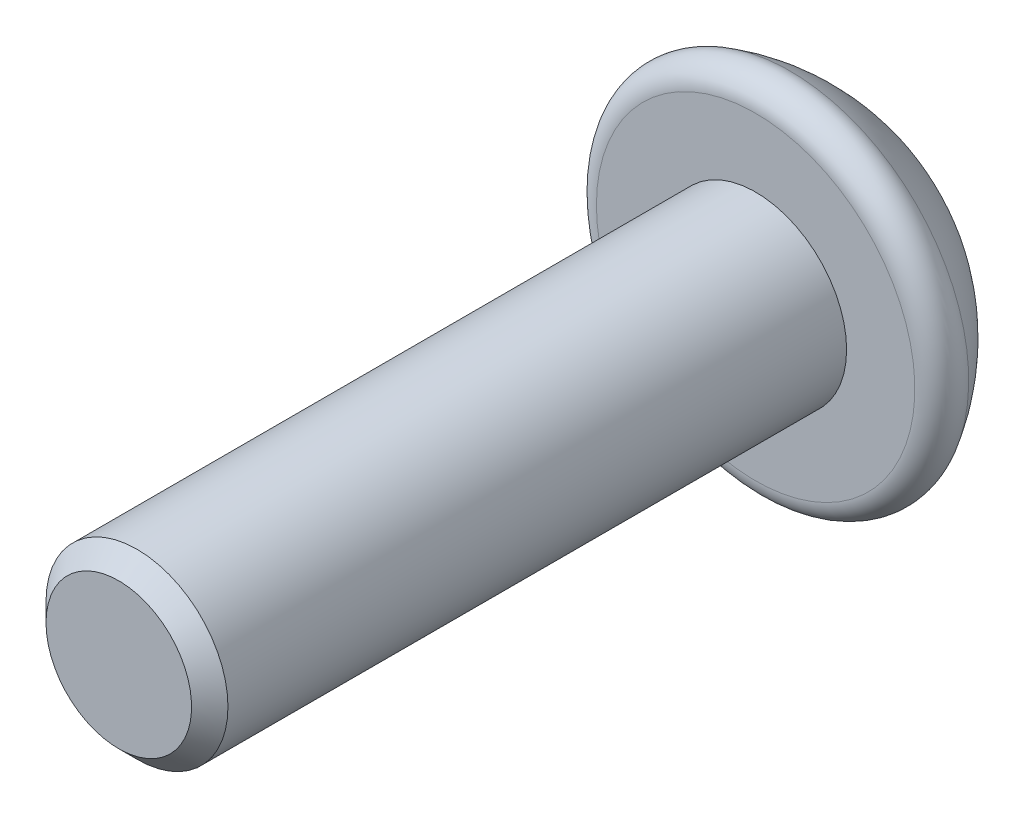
ISO-10303-21;
HEADER;
FILE_DESCRIPTION(('STEP AP214'),'2;1');
FILE_NAME('part.step','',(''),(''),'','','');
FILE_SCHEMA(('AUTOMOTIVE_DESIGN { 1 0 10303 214 1 1 1 1 }'));
ENDSEC;
DATA;
#1=APPLICATION_CONTEXT('core data for automotive mechanical design processes');
#2=APPLICATION_PROTOCOL_DEFINITION('international standard','automotive_design',2000,#1);
#3=PRODUCT_CONTEXT('',#1,'mechanical');
#4=PRODUCT('Part','Part','',(#3));
#5=PRODUCT_RELATED_PRODUCT_CATEGORY('part','',(#4));
#6=PRODUCT_DEFINITION_FORMATION('','',#4);
#7=PRODUCT_DEFINITION_CONTEXT('part definition',#1,'design');
#8=PRODUCT_DEFINITION('design','',#6,#7);
#9=PRODUCT_DEFINITION_SHAPE('','',#8);
#10=(LENGTH_UNIT() NAMED_UNIT(*) SI_UNIT(.MILLI.,.METRE.));
#11=(NAMED_UNIT(*) PLANE_ANGLE_UNIT() SI_UNIT($,.RADIAN.));
#12=(NAMED_UNIT(*) SI_UNIT($,.STERADIAN.) SOLID_ANGLE_UNIT());
#13=UNCERTAINTY_MEASURE_WITH_UNIT(LENGTH_MEASURE(1.E-05),#10,'distance_accuracy_value','');
#14=(GEOMETRIC_REPRESENTATION_CONTEXT(3) GLOBAL_UNCERTAINTY_ASSIGNED_CONTEXT((#13)) GLOBAL_UNIT_ASSIGNED_CONTEXT((#10,
#11,#12)) REPRESENTATION_CONTEXT('',''));
#15=CARTESIAN_POINT('',(0.,0.,0.));
#16=DIRECTION('',(0.,0.,1.));
#17=DIRECTION('',(1.,0.,0.));
#18=AXIS2_PLACEMENT_3D('',#15,#16,#17);
#19=CARTESIAN_POINT('',(0.,0.,1.5625));
#20=DIRECTION('',(0.,0.,-1.));
#21=DIRECTION('',(1.,0.,0.));
#22=AXIS2_PLACEMENT_3D('',#19,#20,#21);
#23=SPHERICAL_SURFACE('',#22,4.5625);
#24=CARTESIAN_POINT('',(0.,0.,-0.753846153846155));
#25=DIRECTION('',(0.,0.,-1.));
#26=DIRECTION('',(-1.,0.,0.));
#27=AXIS2_PLACEMENT_3D('',#24,#25,#26);
#28=CIRCLE('',#27,3.93076923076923);
#29=CARTESIAN_POINT('',(-3.93076923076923,0.,-0.753846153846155));
#30=VERTEX_POINT('',#29);
#31=EDGE_CURVE('E427',#30,#30,#28,.T.);
#32=ORIENTED_EDGE('',*,*,#31,.T.);
#33=EDGE_LOOP('',(#32));
#34=FACE_BOUND('',#33,.T.);
#35=CARTESIAN_POINT('',(-0.6,0.,1.5625));
#36=DIRECTION('',(1.,0.,0.));
#37=DIRECTION('',(0.,1.,0.));
#38=AXIS2_PLACEMENT_3D('',#35,#36,#37);
#39=CIRCLE('',#38,4.52287588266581);
#40=CARTESIAN_POINT('',(-0.6,0.6,-2.92040154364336));
#41=VERTEX_POINT('',#40);
#42=CARTESIAN_POINT('',(-0.6,2.78657495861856,-2.));
#43=VERTEX_POINT('',#42);
#44=EDGE_CURVE('E481',#41,#43,#39,.T.);
#45=ORIENTED_EDGE('',*,*,#44,.F.);
#46=CARTESIAN_POINT('',(0.,0.6,1.5625));
#47=DIRECTION('',(0.,-1.,0.));
#48=DIRECTION('',(1.,0.,0.));
#49=AXIS2_PLACEMENT_3D('',#46,#47,#48);
#50=CIRCLE('',#49,4.52287588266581);
#51=CARTESIAN_POINT('',(-2.78657495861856,0.6,-2.));
#52=VERTEX_POINT('',#51);
#53=EDGE_CURVE('E479',#52,#41,#50,.T.);
#54=ORIENTED_EDGE('',*,*,#53,.F.);
#55=CARTESIAN_POINT('',(0.,0.,-2.));
#56=DIRECTION('',(0.,0.,1.));
#57=DIRECTION('',(1.,0.,0.));
#58=AXIS2_PLACEMENT_3D('',#55,#56,#57);
#59=CIRCLE('',#58,2.85043856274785);
#60=CARTESIAN_POINT('',(-2.78657495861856,-0.6,-2.));
#61=VERTEX_POINT('',#60);
#62=EDGE_CURVE('E478',#52,#61,#59,.T.);
#63=ORIENTED_EDGE('',*,*,#62,.T.);
#64=CARTESIAN_POINT('',(0.,-0.6,1.5625));
#65=DIRECTION('',(0.,1.,0.));
#66=DIRECTION('',(0.,0.,1.));
#67=AXIS2_PLACEMENT_3D('',#64,#65,#66);
#68=CIRCLE('',#67,4.52287588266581);
#69=CARTESIAN_POINT('',(-0.6,-0.6,-2.92040154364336));
#70=VERTEX_POINT('',#69);
#71=EDGE_CURVE('E420',#70,#61,#68,.T.);
#72=ORIENTED_EDGE('',*,*,#71,.F.);
#73=CARTESIAN_POINT('',(-0.6,0.,1.5625));
#74=DIRECTION('',(1.,0.,0.));
#75=DIRECTION('',(0.,1.,0.));
#76=AXIS2_PLACEMENT_3D('',#73,#74,#75);
#77=CIRCLE('',#76,4.52287588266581);
#78=CARTESIAN_POINT('',(-0.6,-2.78657495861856,-2.));
#79=VERTEX_POINT('',#78);
#80=EDGE_CURVE('E373',#79,#70,#77,.T.);
#81=ORIENTED_EDGE('',*,*,#80,.F.);
#82=CARTESIAN_POINT('',(0.6,-2.78657495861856,-2.));
#83=VERTEX_POINT('',#82);
#84=EDGE_CURVE('E433',#79,#83,#59,.T.);
#85=ORIENTED_EDGE('',*,*,#84,.T.);
#86=CARTESIAN_POINT('',(0.6,0.,1.5625));
#87=DIRECTION('',(-1.,0.,0.));
#88=DIRECTION('',(0.,-1.,0.));
#89=AXIS2_PLACEMENT_3D('',#86,#87,#88);
#90=CIRCLE('',#89,4.52287588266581);
#91=CARTESIAN_POINT('',(0.6,-0.6,-2.92040154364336));
#92=VERTEX_POINT('',#91);
#93=EDGE_CURVE('E472',#92,#83,#90,.T.);
#94=ORIENTED_EDGE('',*,*,#93,.F.);
#95=CARTESIAN_POINT('',(0.,-0.6,1.5625));
#96=DIRECTION('',(0.,1.,0.));
#97=DIRECTION('',(0.,0.,1.));
#98=AXIS2_PLACEMENT_3D('',#95,#96,#97);
#99=CIRCLE('',#98,4.52287588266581);
#100=CARTESIAN_POINT('',(2.78657495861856,-0.6,-2.));
#101=VERTEX_POINT('',#100);
#102=EDGE_CURVE('E470',#101,#92,#99,.T.);
#103=ORIENTED_EDGE('',*,*,#102,.F.);
#104=CARTESIAN_POINT('',(2.78657495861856,0.6,-2.));
#105=VERTEX_POINT('',#104);
#106=EDGE_CURVE('E464',#101,#105,#59,.T.);
#107=ORIENTED_EDGE('',*,*,#106,.T.);
#108=CARTESIAN_POINT('',(0.,0.6,1.5625));
#109=DIRECTION('',(0.,-1.,0.));
#110=DIRECTION('',(0.,0.,-1.));
#111=AXIS2_PLACEMENT_3D('',#108,#109,#110);
#112=CIRCLE('',#111,4.52287588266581);
#113=CARTESIAN_POINT('',(0.6,0.6,-2.92040154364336));
#114=VERTEX_POINT('',#113);
#115=EDGE_CURVE('E467',#114,#105,#112,.T.);
#116=ORIENTED_EDGE('',*,*,#115,.F.);
#117=CARTESIAN_POINT('',(0.6,0.,1.5625));
#118=DIRECTION('',(-1.,0.,0.));
#119=DIRECTION('',(0.,-1.,0.));
#120=AXIS2_PLACEMENT_3D('',#117,#118,#119);
#121=CIRCLE('',#120,4.52287588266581);
#122=CARTESIAN_POINT('',(0.6,2.78657495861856,-2.));
#123=VERTEX_POINT('',#122);
#124=EDGE_CURVE('E474',#123,#114,#121,.T.);
#125=ORIENTED_EDGE('',*,*,#124,.F.);
#126=EDGE_CURVE('E468',#123,#43,#59,.T.);
#127=ORIENTED_EDGE('',*,*,#126,.T.);
#128=EDGE_LOOP('',(#45,#54,#63,#72,#81,#85,#94,#103,#107,#116,#125,#127));
#129=FACE_BOUND('',#128,.T.);
#130=ADVANCED_FACE('F350',(#34,#129),#23,.T.);
#131=CARTESIAN_POINT('',(0.,0.,0.));
#132=DIRECTION('',(0.,0.,-1.));
#133=DIRECTION('',(-1.,0.,0.));
#134=AXIS2_PLACEMENT_3D('',#131,#132,#133);
#135=PLANE('',#134);
#136=CARTESIAN_POINT('',(0.,0.,0.));
#137=DIRECTION('',(0.,0.,1.));
#138=DIRECTION('',(1.,0.,0.));
#139=AXIS2_PLACEMENT_3D('',#136,#137,#138);
#140=CIRCLE('',#139,2.);
#141=CARTESIAN_POINT('',(2.,0.,0.));
#142=VERTEX_POINT('',#141);
#143=EDGE_CURVE('E424',#142,#142,#140,.T.);
#144=ORIENTED_EDGE('',*,*,#143,.F.);
#145=EDGE_LOOP('',(#144));
#146=FACE_BOUND('',#145,.T.);
#147=CARTESIAN_POINT('',(0.,0.,0.));
#148=DIRECTION('',(0.,0.,-1.));
#149=DIRECTION('',(-1.,0.,0.));
#150=AXIS2_PLACEMENT_3D('',#147,#148,#149);
#151=CIRCLE('',#150,3.5);
#152=CARTESIAN_POINT('',(-3.5,0.,0.));
#153=VERTEX_POINT('',#152);
#154=EDGE_CURVE('E461',#153,#153,#151,.T.);
#155=ORIENTED_EDGE('',*,*,#154,.F.);
#156=EDGE_LOOP('',(#155));
#157=FACE_BOUND('',#156,.T.);
#158=ADVANCED_FACE('F352',(#146,#157),#135,.F.);
#159=CARTESIAN_POINT('',(0.,0.,-0.5));
#160=DIRECTION('',(0.,0.,-1.));
#161=DIRECTION('',(-1.,0.,0.));
#162=AXIS2_PLACEMENT_3D('',#159,#160,#161);
#163=TOROIDAL_SURFACE('',#162,3.5,0.500000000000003);
#164=ORIENTED_EDGE('',*,*,#31,.F.);
#165=EDGE_LOOP('',(#164));
#166=FACE_BOUND('',#165,.T.);
#167=ORIENTED_EDGE('',*,*,#154,.T.);
#168=EDGE_LOOP('',(#167));
#169=FACE_BOUND('',#168,.T.);
#170=ADVANCED_FACE('F506',(#166,#169),#163,.T.);
#171=CARTESIAN_POINT('',(-3.5,-0.6,-2.));
#172=DIRECTION('',(0.,1.,0.));
#173=DIRECTION('',(0.,0.,1.));
#174=AXIS2_PLACEMENT_3D('',#171,#172,#173);
#175=PLANE('',#174);
#176=ORIENTED_EDGE('',*,*,#71,.T.);
#177=DIRECTION('',(1.,0.,0.));
#178=VECTOR('',#177,1.);
#179=CARTESIAN_POINT('',(-3.5,-0.6,-2.));
#180=LINE('',#179,#178);
#181=CARTESIAN_POINT('',(-0.6,-0.6,-2.));
#182=VERTEX_POINT('',#181);
#183=EDGE_CURVE('E416',#61,#182,#180,.T.);
#184=ORIENTED_EDGE('',*,*,#183,.T.);
#185=DIRECTION('',(0.,0.,-1.));
#186=VECTOR('',#185,1.);
#187=CARTESIAN_POINT('',(-0.6,-0.6,-2.));
#188=LINE('',#187,#186);
#189=EDGE_CURVE('E418',#182,#70,#188,.T.);
#190=ORIENTED_EDGE('',*,*,#189,.T.);
#191=EDGE_LOOP('',(#176,#184,#190));
#192=FACE_BOUND('',#191,.T.);
#193=ADVANCED_FACE('F417',(#192),#175,.T.);
#194=CARTESIAN_POINT('',(-0.6,-0.6,-2.));
#195=DIRECTION('',(1.,0.,0.));
#196=DIRECTION('',(0.,1.,0.));
#197=AXIS2_PLACEMENT_3D('',#194,#195,#196);
#198=PLANE('',#197);
#199=ORIENTED_EDGE('',*,*,#80,.T.);
#200=ORIENTED_EDGE('',*,*,#189,.F.);
#201=DIRECTION('',(0.,-1.,0.));
#202=VECTOR('',#201,1.);
#203=CARTESIAN_POINT('',(-0.6,-0.6,-2.));
#204=LINE('',#203,#202);
#205=EDGE_CURVE('E423',#182,#79,#204,.T.);
#206=ORIENTED_EDGE('',*,*,#205,.T.);
#207=EDGE_LOOP('',(#199,#200,#206));
#208=FACE_BOUND('',#207,.T.);
#209=ADVANCED_FACE('F426',(#208),#198,.T.);
#210=CARTESIAN_POINT('',(0.6,-0.6,-2.));
#211=DIRECTION('',(-1.,0.,0.));
#212=DIRECTION('',(0.,-1.,0.));
#213=AXIS2_PLACEMENT_3D('',#210,#211,#212);
#214=PLANE('',#213);
#215=ORIENTED_EDGE('',*,*,#93,.T.);
#216=DIRECTION('',(0.,1.,0.));
#217=VECTOR('',#216,1.);
#218=CARTESIAN_POINT('',(0.6,-0.6,-2.));
#219=LINE('',#218,#217);
#220=CARTESIAN_POINT('',(0.6,-0.6,-2.));
#221=VERTEX_POINT('',#220);
#222=EDGE_CURVE('E434',#83,#221,#219,.T.);
#223=ORIENTED_EDGE('',*,*,#222,.T.);
#224=DIRECTION('',(0.,0.,-1.));
#225=VECTOR('',#224,1.);
#226=CARTESIAN_POINT('',(0.6,-0.6,-2.));
#227=LINE('',#226,#225);
#228=EDGE_CURVE('E428',#221,#92,#227,.T.);
#229=ORIENTED_EDGE('',*,*,#228,.T.);
#230=EDGE_LOOP('',(#215,#223,#229));
#231=FACE_BOUND('',#230,.T.);
#232=ADVANCED_FACE('F521',(#231),#214,.T.);
#233=CARTESIAN_POINT('',(0.6,-0.6,-2.));
#234=DIRECTION('',(0.,1.,0.));
#235=DIRECTION('',(0.,0.,1.));
#236=AXIS2_PLACEMENT_3D('',#233,#234,#235);
#237=PLANE('',#236);
#238=ORIENTED_EDGE('',*,*,#102,.T.);
#239=ORIENTED_EDGE('',*,*,#228,.F.);
#240=DIRECTION('',(1.,0.,0.));
#241=VECTOR('',#240,1.);
#242=CARTESIAN_POINT('',(0.6,-0.6,-2.));
#243=LINE('',#242,#241);
#244=EDGE_CURVE('E436',#221,#101,#243,.T.);
#245=ORIENTED_EDGE('',*,*,#244,.T.);
#246=EDGE_LOOP('',(#238,#239,#245));
#247=FACE_BOUND('',#246,.T.);
#248=ADVANCED_FACE('F525',(#247),#237,.T.);
#249=CARTESIAN_POINT('',(0.6,0.6,-2.));
#250=DIRECTION('',(0.,-1.,0.));
#251=DIRECTION('',(0.,0.,-1.));
#252=AXIS2_PLACEMENT_3D('',#249,#250,#251);
#253=PLANE('',#252);
#254=ORIENTED_EDGE('',*,*,#115,.T.);
#255=DIRECTION('',(-1.,0.,0.));
#256=VECTOR('',#255,1.);
#257=CARTESIAN_POINT('',(0.6,0.6,-2.));
#258=LINE('',#257,#256);
#259=CARTESIAN_POINT('',(0.6,0.6,-2.));
#260=VERTEX_POINT('',#259);
#261=EDGE_CURVE('E365',#105,#260,#258,.T.);
#262=ORIENTED_EDGE('',*,*,#261,.T.);
#263=DIRECTION('',(0.,0.,-1.));
#264=VECTOR('',#263,1.);
#265=CARTESIAN_POINT('',(0.6,0.6,-2.));
#266=LINE('',#265,#264);
#267=EDGE_CURVE('E454',#260,#114,#266,.T.);
#268=ORIENTED_EDGE('',*,*,#267,.T.);
#269=EDGE_LOOP('',(#254,#262,#268));
#270=FACE_BOUND('',#269,.T.);
#271=ADVANCED_FACE('F531',(#270),#253,.T.);
#272=CARTESIAN_POINT('',(0.6,3.5,-2.));
#273=DIRECTION('',(-1.,0.,0.));
#274=DIRECTION('',(0.,-1.,0.));
#275=AXIS2_PLACEMENT_3D('',#272,#273,#274);
#276=PLANE('',#275);
#277=ORIENTED_EDGE('',*,*,#124,.T.);
#278=ORIENTED_EDGE('',*,*,#267,.F.);
#279=DIRECTION('',(0.,1.,0.));
#280=VECTOR('',#279,1.);
#281=CARTESIAN_POINT('',(0.6,3.5,-2.));
#282=LINE('',#281,#280);
#283=EDGE_CURVE('E443',#260,#123,#282,.T.);
#284=ORIENTED_EDGE('',*,*,#283,.T.);
#285=EDGE_LOOP('',(#277,#278,#284));
#286=FACE_BOUND('',#285,.T.);
#287=ADVANCED_FACE('F535',(#286),#276,.T.);
#288=CARTESIAN_POINT('',(-0.6,3.5,-2.));
#289=DIRECTION('',(1.,0.,0.));
#290=DIRECTION('',(0.,1.,0.));
#291=AXIS2_PLACEMENT_3D('',#288,#289,#290);
#292=PLANE('',#291);
#293=ORIENTED_EDGE('',*,*,#44,.T.);
#294=DIRECTION('',(0.,-1.,0.));
#295=VECTOR('',#294,1.);
#296=CARTESIAN_POINT('',(-0.6,3.5,-2.));
#297=LINE('',#296,#295);
#298=CARTESIAN_POINT('',(-0.6,0.6,-2.));
#299=VERTEX_POINT('',#298);
#300=EDGE_CURVE('E446',#43,#299,#297,.T.);
#301=ORIENTED_EDGE('',*,*,#300,.T.);
#302=DIRECTION('',(0.,0.,-1.));
#303=VECTOR('',#302,1.);
#304=CARTESIAN_POINT('',(-0.6,0.6,-2.));
#305=LINE('',#304,#303);
#306=EDGE_CURVE('E451',#299,#41,#305,.T.);
#307=ORIENTED_EDGE('',*,*,#306,.T.);
#308=EDGE_LOOP('',(#293,#301,#307));
#309=FACE_BOUND('',#308,.T.);
#310=ADVANCED_FACE('F539',(#309),#292,.T.);
#311=CARTESIAN_POINT('',(-3.5,0.6,-2.));
#312=DIRECTION('',(0.,-1.,0.));
#313=DIRECTION('',(1.,0.,0.));
#314=AXIS2_PLACEMENT_3D('',#311,#312,#313);
#315=PLANE('',#314);
#316=ORIENTED_EDGE('',*,*,#53,.T.);
#317=ORIENTED_EDGE('',*,*,#306,.F.);
#318=DIRECTION('',(-1.,0.,0.));
#319=VECTOR('',#318,1.);
#320=CARTESIAN_POINT('',(-3.5,0.6,-2.));
#321=LINE('',#320,#319);
#322=EDGE_CURVE('E448',#299,#52,#321,.T.);
#323=ORIENTED_EDGE('',*,*,#322,.T.);
#324=EDGE_LOOP('',(#316,#317,#323));
#325=FACE_BOUND('',#324,.T.);
#326=ADVANCED_FACE('F543',(#325),#315,.T.);
#327=CARTESIAN_POINT('',(-3.5,-0.6,-2.));
#328=DIRECTION('',(0.,0.,1.));
#329=DIRECTION('',(1.,0.,0.));
#330=AXIS2_PLACEMENT_3D('',#327,#328,#329);
#331=PLANE('',#330);
#332=ORIENTED_EDGE('',*,*,#283,.F.);
#333=ORIENTED_EDGE('',*,*,#261,.F.);
#334=ORIENTED_EDGE('',*,*,#106,.F.);
#335=ORIENTED_EDGE('',*,*,#244,.F.);
#336=ORIENTED_EDGE('',*,*,#222,.F.);
#337=ORIENTED_EDGE('',*,*,#84,.F.);
#338=ORIENTED_EDGE('',*,*,#205,.F.);
#339=ORIENTED_EDGE('',*,*,#183,.F.);
#340=ORIENTED_EDGE('',*,*,#62,.F.);
#341=ORIENTED_EDGE('',*,*,#322,.F.);
#342=ORIENTED_EDGE('',*,*,#300,.F.);
#343=ORIENTED_EDGE('',*,*,#126,.F.);
#344=EDGE_LOOP('',(#332,#333,#334,#335,#336,#337,#338,#339,#340,#341,#342,#343));
#345=FACE_BOUND('',#344,.T.);
#346=ADVANCED_FACE('F430',(#345),#331,.F.);
#347=CARTESIAN_POINT('',(0.,0.,14.));
#348=DIRECTION('',(0.,0.,1.));
#349=DIRECTION('',(1.,0.,0.));
#350=AXIS2_PLACEMENT_3D('',#347,#348,#349);
#351=PLANE('',#350);
#352=CARTESIAN_POINT('',(0.,0.,14.));
#353=DIRECTION('',(0.,0.,1.));
#354=DIRECTION('',(1.,0.,0.));
#355=AXIS2_PLACEMENT_3D('',#352,#353,#354);
#356=CIRCLE('',#355,1.6);
#357=CARTESIAN_POINT('',(-1.6,0.,14.));
#358=VERTEX_POINT('',#357);
#359=EDGE_CURVE('E358',#358,#358,#356,.T.);
#360=ORIENTED_EDGE('',*,*,#359,.T.);
#361=EDGE_LOOP('',(#360));
#362=FACE_BOUND('',#361,.T.);
#363=ADVANCED_FACE('F485',(#362),#351,.T.);
#364=CARTESIAN_POINT('',(0.,0.,0.));
#365=DIRECTION('',(0.,0.,1.));
#366=DIRECTION('',(1.,0.,0.));
#367=AXIS2_PLACEMENT_3D('',#364,#365,#366);
#368=CYLINDRICAL_SURFACE('',#367,2.);
#369=CARTESIAN_POINT('',(0.,0.,13.6));
#370=DIRECTION('',(0.,0.,1.));
#371=DIRECTION('',(1.,0.,0.));
#372=AXIS2_PLACEMENT_3D('',#369,#370,#371);
#373=CIRCLE('',#372,2.);
#374=CARTESIAN_POINT('',(-2.,0.,13.6));
#375=VERTEX_POINT('',#374);
#376=EDGE_CURVE('E11',#375,#375,#373,.F.);
#377=ORIENTED_EDGE('',*,*,#376,.T.);
#378=EDGE_LOOP('',(#377));
#379=FACE_BOUND('',#378,.T.);
#380=ORIENTED_EDGE('',*,*,#143,.T.);
#381=EDGE_LOOP('',(#380));
#382=FACE_BOUND('',#381,.T.);
#383=ADVANCED_FACE('F489',(#379,#382),#368,.T.);
#384=CARTESIAN_POINT('',(0.,0.,14.));
#385=DIRECTION('',(0.,0.,-1.));
#386=DIRECTION('',(-1.,0.,0.));
#387=AXIS2_PLACEMENT_3D('',#384,#385,#386);
#388=CONICAL_SURFACE('',#387,1.6,0.785398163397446);
#389=CARTESIAN_POINT('',(-2.,0.,13.6));
#390=CARTESIAN_POINT('',(-1.99583333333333,0.,13.6041666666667));
#391=CARTESIAN_POINT('',(-1.99166666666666,0.,13.6083333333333));
#392=CARTESIAN_POINT('',(-1.98333333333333,0.,13.6166666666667));
#393=CARTESIAN_POINT('',(-1.97916666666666,0.,13.6208333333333));
#394=CARTESIAN_POINT('',(-1.97083333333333,0.,13.6291666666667));
#395=CARTESIAN_POINT('',(-1.96666666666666,0.,13.6333333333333));
#396=CARTESIAN_POINT('',(-1.95833333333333,0.,13.6416666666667));
#397=CARTESIAN_POINT('',(-1.95416666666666,0.,13.6458333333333));
#398=CARTESIAN_POINT('',(-1.94583333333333,0.,13.6541666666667));
#399=CARTESIAN_POINT('',(-1.94166666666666,0.,13.6583333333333));
#400=CARTESIAN_POINT('',(-1.93333333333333,0.,13.6666666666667));
#401=CARTESIAN_POINT('',(-1.92916666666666,0.,13.6708333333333));
#402=CARTESIAN_POINT('',(-1.92083333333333,0.,13.6791666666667));
#403=CARTESIAN_POINT('',(-1.91666666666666,0.,13.6833333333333));
#404=CARTESIAN_POINT('',(-1.90833333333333,0.,13.6916666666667));
#405=CARTESIAN_POINT('',(-1.90416666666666,0.,13.6958333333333));
#406=CARTESIAN_POINT('',(-1.89583333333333,0.,13.7041666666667));
#407=CARTESIAN_POINT('',(-1.89166666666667,0.,13.7083333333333));
#408=CARTESIAN_POINT('',(-1.88333333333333,0.,13.7166666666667));
#409=CARTESIAN_POINT('',(-1.87916666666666,0.,13.7208333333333));
#410=CARTESIAN_POINT('',(-1.87083333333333,0.,13.7291666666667));
#411=CARTESIAN_POINT('',(-1.86666666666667,0.,13.7333333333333));
#412=CARTESIAN_POINT('',(-1.85833333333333,0.,13.7416666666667));
#413=CARTESIAN_POINT('',(-1.85416666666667,0.,13.7458333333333));
#414=CARTESIAN_POINT('',(-1.84583333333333,0.,13.7541666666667));
#415=CARTESIAN_POINT('',(-1.84166666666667,0.,13.7583333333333));
#416=CARTESIAN_POINT('',(-1.83333333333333,0.,13.7666666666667));
#417=CARTESIAN_POINT('',(-1.82916666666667,0.,13.7708333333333));
#418=CARTESIAN_POINT('',(-1.82083333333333,0.,13.7791666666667));
#419=CARTESIAN_POINT('',(-1.81666666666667,0.,13.7833333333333));
#420=CARTESIAN_POINT('',(-1.80833333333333,0.,13.7916666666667));
#421=CARTESIAN_POINT('',(-1.80416666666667,0.,13.7958333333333));
#422=CARTESIAN_POINT('',(-1.79583333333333,0.,13.8041666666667));
#423=CARTESIAN_POINT('',(-1.79166666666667,0.,13.8083333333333));
#424=CARTESIAN_POINT('',(-1.78333333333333,0.,13.8166666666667));
#425=CARTESIAN_POINT('',(-1.77916666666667,0.,13.8208333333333));
#426=CARTESIAN_POINT('',(-1.77083333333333,0.,13.8291666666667));
#427=CARTESIAN_POINT('',(-1.76666666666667,0.,13.8333333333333));
#428=CARTESIAN_POINT('',(-1.75833333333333,0.,13.8416666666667));
#429=CARTESIAN_POINT('',(-1.75416666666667,0.,13.8458333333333));
#430=CARTESIAN_POINT('',(-1.74583333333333,0.,13.8541666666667));
#431=CARTESIAN_POINT('',(-1.74166666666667,0.,13.8583333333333));
#432=CARTESIAN_POINT('',(-1.73333333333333,0.,13.8666666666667));
#433=CARTESIAN_POINT('',(-1.72916666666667,0.,13.8708333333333));
#434=CARTESIAN_POINT('',(-1.72083333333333,0.,13.8791666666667));
#435=CARTESIAN_POINT('',(-1.71666666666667,0.,13.8833333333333));
#436=CARTESIAN_POINT('',(-1.70833333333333,0.,13.8916666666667));
#437=CARTESIAN_POINT('',(-1.70416666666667,0.,13.8958333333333));
#438=CARTESIAN_POINT('',(-1.69583333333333,0.,13.9041666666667));
#439=CARTESIAN_POINT('',(-1.69166666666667,0.,13.9083333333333));
#440=CARTESIAN_POINT('',(-1.68333333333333,0.,13.9166666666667));
#441=CARTESIAN_POINT('',(-1.67916666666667,0.,13.9208333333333));
#442=CARTESIAN_POINT('',(-1.67083333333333,0.,13.9291666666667));
#443=CARTESIAN_POINT('',(-1.66666666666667,0.,13.9333333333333));
#444=CARTESIAN_POINT('',(-1.65833333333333,0.,13.9416666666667));
#445=CARTESIAN_POINT('',(-1.65416666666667,0.,13.9458333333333));
#446=CARTESIAN_POINT('',(-1.64583333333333,0.,13.9541666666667));
#447=CARTESIAN_POINT('',(-1.64166666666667,0.,13.9583333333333));
#448=CARTESIAN_POINT('',(-1.63333333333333,0.,13.9666666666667));
#449=CARTESIAN_POINT('',(-1.62916666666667,0.,13.9708333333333));
#450=CARTESIAN_POINT('',(-1.62083333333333,0.,13.9791666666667));
#451=CARTESIAN_POINT('',(-1.61666666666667,0.,13.9833333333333));
#452=CARTESIAN_POINT('',(-1.60833333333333,0.,13.9916666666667));
#453=CARTESIAN_POINT('',(-1.60416666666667,0.,13.9958333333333));
#454=CARTESIAN_POINT('',(-1.6,0.,14.));
#455=B_SPLINE_CURVE_WITH_KNOTS('',3,(#389,#390,#391,#392,#393,#394,#395,#396,#397,#398,#399,
#400,#401,#402,#403,#404,#405,#406,#407,#408,#409,#410,#411,#412,#413,#414,#415,#416,#417,#418,
#419,#420,#421,#422,#423,#424,#425,#426,#427,#428,#429,#430,#431,#432,#433,#434,#435,#436,#437,
#438,#439,#440,#441,#442,#443,#444,#445,#446,#447,#448,#449,#450,#451,#452,#453,#454),
.UNSPECIFIED.,.F.,.F.,(4,2,2,2,2,2,2,2,2,2,2,2,2,2,2,2,2,2,2,2,2,2,2,2,2,2,2,2,2,2,2,2,4),(0.,
0.0176776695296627,0.0353553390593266,0.0530330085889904,0.0707106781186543,0.088388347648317,
0.106066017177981,0.123743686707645,0.141421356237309,0.159099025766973,0.176776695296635,
0.194454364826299,0.212132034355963,0.229809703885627,0.247487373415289,0.265165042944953,
0.282842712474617,0.300520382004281,0.318198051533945,0.335875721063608,0.353553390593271,
0.371231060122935,0.388908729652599,0.406586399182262,0.424264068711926,0.441941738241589,
0.459619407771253,0.477297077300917,0.49497474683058,0.512652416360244,0.530330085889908,
0.548007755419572,0.565685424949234),.UNSPECIFIED.);
#456=EDGE_CURVE('BSEAM487',#375,#358,#455,.T.);
#457=ORIENTED_EDGE('',*,*,#376,.F.);
#458=ORIENTED_EDGE('',*,*,#359,.F.);
#459=ORIENTED_EDGE('',*,*,#456,.T.);
#460=ORIENTED_EDGE('',*,*,#456,.F.);
#461=EDGE_LOOP('',(#457,#459,#458,#460));
#462=FACE_BOUND('',#461,.T.);
#463=ADVANCED_FACE('F487',(#462),#388,.T.);
#464=CLOSED_SHELL('',(#130,#158,#170,#193,#209,#232,#248,#271,#287,#310,#326,#346,#363,#383,#463));
#465=MANIFOLD_SOLID_BREP('B2',#464);
#466=ADVANCED_BREP_SHAPE_REPRESENTATION('',(#18,#465),#14);
#467=SHAPE_DEFINITION_REPRESENTATION(#9,#466);
ENDSEC;
END-ISO-10303-21;
